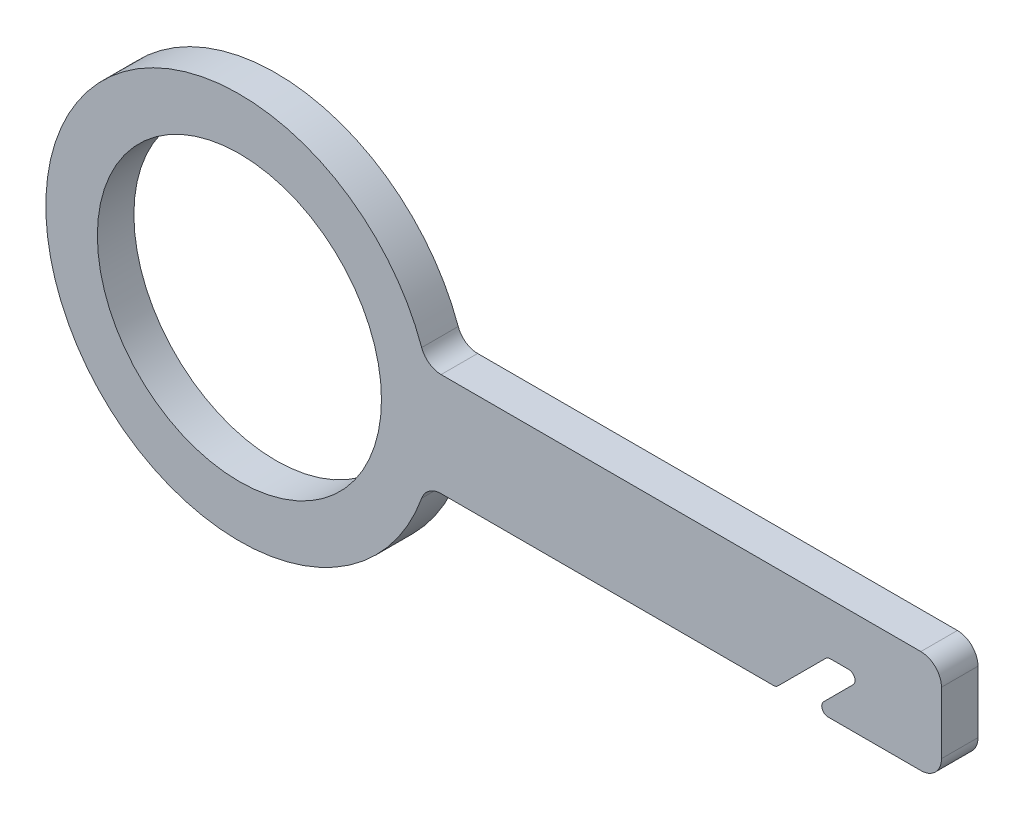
from build123d import *

# Parameters (mm, degrees)
SKETCH1_R           = 23.85
SKETCH1_R_2         = 17.5
BOSS_EXTRUDE2_DEPTH = 4.5
FILLET3_R           = 2.54
FILLET4_R           = 0.79375


with BuildPart() as part:
    # Sketch1 → Boss-Extrude2 (new body)
    # profile 1 of 2: a face of its own
    with BuildSketch(Plane.XY):
        Circle(SKETCH1_R)
        Circle(SKETCH1_R_2, mode=Mode.SUBTRACT)
    # profile 2 of 2: a face of its own
    with BuildSketch(Plane.XY):
        with BuildLine():
            Line((86.489127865, 6.35), (22.989127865, 6.35))
            ThreePointArc((22.989127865, 6.35), (23.63380206, 3.204044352), (23.85, 0))
            ThreePointArc((23.85, 0), (23.63380206, -3.204044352), (22.989127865, -6.35))
            Line((22.989127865, -6.35), (66.114127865, -6.35))
            Line((66.114127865, -6.35), (72.464127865, 0))
            Line((72.464127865, 0), (76.964127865, 0))
            Line((76.964127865, 0), (70.614127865, -6.35))
            Line((70.614127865, -6.35), (86.489127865, -6.35))
            Line((86.489127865, -6.35), (86.489127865, 6.35))
        make_face()
    extrude(amount=BOSS_EXTRUDE2_DEPTH)

    # Fillet3
    fillet3_edges = [part.edges().sort_by_distance(p)[0] for p in [
        (86.489127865, 6.35, 2.25),
        (86.489127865, -6.35, 2.25),
        (22.989127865, -6.35, 2.25),
        (22.989127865, 6.35, 2.25),
    ]]
    fillet(fillet3_edges, radius=FILLET3_R)

    # Fillet4
    fillet4_edges = [part.edges().sort_by_distance(p)[0] for p in [
        (70.614127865, -6.35, 2.25),
        (76.964127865, 0, 2.25),
        (72.464127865, 0, 2.25),
        (66.114127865, -6.35, 2.25),
    ]]
    fillet(fillet4_edges, radius=FILLET4_R)


solid = part.part
